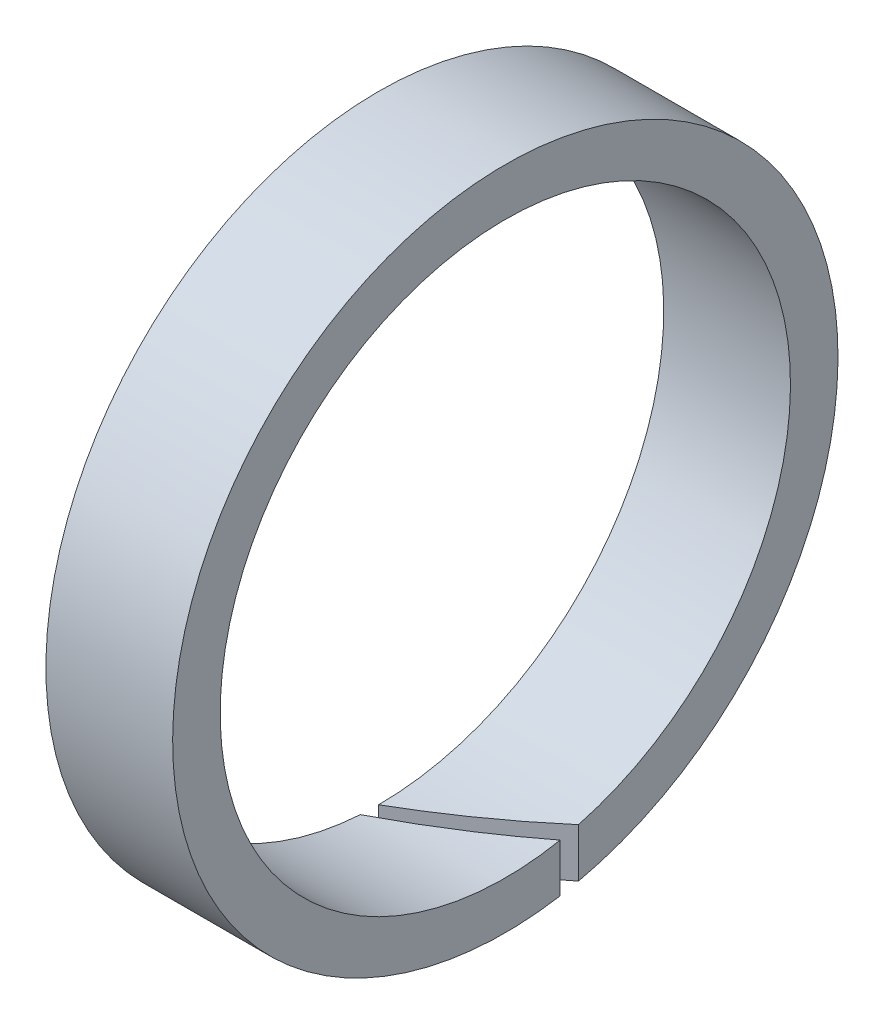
ISO-10303-21;
HEADER;
FILE_DESCRIPTION(('STEP AP214'),'2;1');
FILE_NAME('part.step','',(''),(''),'','','');
FILE_SCHEMA(('AUTOMOTIVE_DESIGN { 1 0 10303 214 1 1 1 1 }'));
ENDSEC;
DATA;
#1=APPLICATION_CONTEXT('core data for automotive mechanical design processes');
#2=APPLICATION_PROTOCOL_DEFINITION('international standard','automotive_design',2000,#1);
#3=PRODUCT_CONTEXT('',#1,'mechanical');
#4=PRODUCT('Part','Part','',(#3));
#5=PRODUCT_RELATED_PRODUCT_CATEGORY('part','',(#4));
#6=PRODUCT_DEFINITION_FORMATION('','',#4);
#7=PRODUCT_DEFINITION_CONTEXT('part definition',#1,'design');
#8=PRODUCT_DEFINITION('design','',#6,#7);
#9=PRODUCT_DEFINITION_SHAPE('','',#8);
#10=(LENGTH_UNIT() NAMED_UNIT(*) SI_UNIT(.MILLI.,.METRE.));
#11=(NAMED_UNIT(*) PLANE_ANGLE_UNIT() SI_UNIT($,.RADIAN.));
#12=(NAMED_UNIT(*) SI_UNIT($,.STERADIAN.) SOLID_ANGLE_UNIT());
#13=UNCERTAINTY_MEASURE_WITH_UNIT(LENGTH_MEASURE(1.E-05),#10,'distance_accuracy_value','');
#14=(GEOMETRIC_REPRESENTATION_CONTEXT(3) GLOBAL_UNCERTAINTY_ASSIGNED_CONTEXT((#13)) GLOBAL_UNIT_ASSIGNED_CONTEXT((#10,
#11,#12)) REPRESENTATION_CONTEXT('',''));
#15=CARTESIAN_POINT('',(0.,0.,0.));
#16=DIRECTION('',(0.,0.,1.));
#17=DIRECTION('',(1.,0.,0.));
#18=AXIS2_PLACEMENT_3D('',#15,#16,#17);
#19=CARTESIAN_POINT('',(0.,10.5,0.));
#20=DIRECTION('',(1.,0.,0.));
#21=DIRECTION('',(0.,0.,-1.));
#22=AXIS2_PLACEMENT_3D('',#19,#20,#21);
#23=PLANE('',#22);
#24=CARTESIAN_POINT('',(0.,0.,0.));
#25=DIRECTION('',(-1.,0.,0.));
#26=DIRECTION('',(0.,0.,1.));
#27=AXIS2_PLACEMENT_3D('',#24,#25,#26);
#28=CIRCLE('',#27,10.5);
#29=CARTESIAN_POINT('',(0.,-10.484114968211,0.577350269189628));
#30=VERTEX_POINT('',#29);
#31=CARTESIAN_POINT('',(0.,-10.5,0.));
#32=VERTEX_POINT('',#31);
#33=EDGE_CURVE('E81',#30,#32,#28,.T.);
#34=ORIENTED_EDGE('',*,*,#33,.T.);
#35=DIRECTION('',(0.,1.,0.));
#36=VECTOR('',#35,1.);
#37=CARTESIAN_POINT('',(0.,-10.5,0.));
#38=LINE('',#37,#36);
#39=CARTESIAN_POINT('',(0.,-9.00000000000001,0.));
#40=VERTEX_POINT('',#39);
#41=EDGE_CURVE('E67',#32,#40,#38,.T.);
#42=ORIENTED_EDGE('',*,*,#41,.T.);
#43=CARTESIAN_POINT('',(0.,0.,0.));
#44=DIRECTION('',(-1.,0.,0.));
#45=DIRECTION('',(0.,0.,1.));
#46=AXIS2_PLACEMENT_3D('',#43,#44,#45);
#47=CIRCLE('',#46,9.);
#48=CARTESIAN_POINT('',(0.,-8.98146239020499,0.577350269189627));
#49=VERTEX_POINT('',#48);
#50=EDGE_CURVE('E84',#49,#40,#47,.T.);
#51=ORIENTED_EDGE('',*,*,#50,.F.);
#52=DIRECTION('',(0.,1.,0.));
#53=VECTOR('',#52,1.);
#54=CARTESIAN_POINT('',(0.,-10.5,0.577350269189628));
#55=LINE('',#54,#53);
#56=EDGE_CURVE('E44',#30,#49,#55,.T.);
#57=ORIENTED_EDGE('',*,*,#56,.F.);
#58=EDGE_LOOP('',(#34,#42,#51,#57));
#59=FACE_BOUND('',#58,.T.);
#60=ADVANCED_FACE('F30',(#59),#23,.F.);
#61=CARTESIAN_POINT('',(0.,0.,0.));
#62=DIRECTION('',(-1.,0.,0.));
#63=DIRECTION('',(0.,0.,1.));
#64=AXIS2_PLACEMENT_3D('',#61,#62,#63);
#65=CYLINDRICAL_SURFACE('',#64,10.5);
#66=ORIENTED_EDGE('',*,*,#33,.F.);
#67=CARTESIAN_POINT('',(0.999999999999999,0.,0.));
#68=DIRECTION('',(0.500000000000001,0.,0.866025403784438));
#69=DIRECTION('',(-0.866025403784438,0.,0.500000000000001));
#70=AXIS2_PLACEMENT_3D('',#67,#68,#69);
#71=ELLIPSE('',#70,20.9999999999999,10.5);
#72=CARTESIAN_POINT('',(4.,-10.356157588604,-1.73205080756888));
#73=VERTEX_POINT('',#72);
#74=EDGE_CURVE('E75',#30,#73,#71,.T.);
#75=ORIENTED_EDGE('',*,*,#74,.T.);
#76=CARTESIAN_POINT('',(4.,0.,0.));
#77=DIRECTION('',(-1.,0.,0.));
#78=DIRECTION('',(0.,0.,1.));
#79=AXIS2_PLACEMENT_3D('',#76,#77,#78);
#80=CIRCLE('',#79,10.5);
#81=CARTESIAN_POINT('',(4.,-10.2428837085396,-2.30940107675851));
#82=VERTEX_POINT('',#81);
#83=EDGE_CURVE('E83',#73,#82,#80,.T.);
#84=ORIENTED_EDGE('',*,*,#83,.T.);
#85=CARTESIAN_POINT('',(0.,0.,0.));
#86=DIRECTION('',(-0.500000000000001,0.,-0.866025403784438));
#87=DIRECTION('',(-0.866025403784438,0.,0.500000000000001));
#88=AXIS2_PLACEMENT_3D('',#85,#86,#87);
#89=ELLIPSE('',#88,21.,10.5);
#90=EDGE_CURVE('E70',#82,#32,#89,.T.);
#91=ORIENTED_EDGE('',*,*,#90,.T.);
#92=EDGE_LOOP('',(#66,#75,#84,#91));
#93=FACE_BOUND('',#92,.T.);
#94=ADVANCED_FACE('F80',(#93),#65,.T.);
#95=CARTESIAN_POINT('',(4.,9.,0.));
#96=DIRECTION('',(-1.,0.,0.));
#97=DIRECTION('',(0.,0.,1.));
#98=AXIS2_PLACEMENT_3D('',#95,#96,#97);
#99=PLANE('',#98);
#100=CARTESIAN_POINT('',(4.,0.,0.));
#101=DIRECTION('',(-1.,0.,0.));
#102=DIRECTION('',(0.,0.,1.));
#103=AXIS2_PLACEMENT_3D('',#100,#101,#102);
#104=CIRCLE('',#103,9.);
#105=CARTESIAN_POINT('',(4.,-8.83176086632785,-1.73205080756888));
#106=VERTEX_POINT('',#105);
#107=CARTESIAN_POINT('',(4.,-8.69865890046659,-2.30940107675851));
#108=VERTEX_POINT('',#107);
#109=EDGE_CURVE('E87',#106,#108,#104,.T.);
#110=ORIENTED_EDGE('',*,*,#109,.T.);
#111=DIRECTION('',(0.,1.,0.));
#112=VECTOR('',#111,1.);
#113=CARTESIAN_POINT('',(4.,-10.5,-2.30940107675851));
#114=LINE('',#113,#112);
#115=EDGE_CURVE('E52',#82,#108,#114,.T.);
#116=ORIENTED_EDGE('',*,*,#115,.F.);
#117=ORIENTED_EDGE('',*,*,#83,.F.);
#118=DIRECTION('',(0.,1.,0.));
#119=VECTOR('',#118,1.);
#120=CARTESIAN_POINT('',(4.,-10.5,-1.73205080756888));
#121=LINE('',#120,#119);
#122=EDGE_CURVE('E95',#73,#106,#121,.T.);
#123=ORIENTED_EDGE('',*,*,#122,.T.);
#124=EDGE_LOOP('',(#110,#116,#117,#123));
#125=FACE_BOUND('',#124,.T.);
#126=ADVANCED_FACE('F101',(#125),#99,.F.);
#127=CARTESIAN_POINT('',(0.,0.,0.));
#128=DIRECTION('',(-1.,0.,0.));
#129=DIRECTION('',(0.,0.,1.));
#130=AXIS2_PLACEMENT_3D('',#127,#128,#129);
#131=CYLINDRICAL_SURFACE('',#130,9.);
#132=ORIENTED_EDGE('',*,*,#50,.T.);
#133=CARTESIAN_POINT('',(0.,0.,0.));
#134=DIRECTION('',(-0.500000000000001,0.,-0.866025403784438));
#135=DIRECTION('',(-0.866025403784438,0.,0.500000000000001));
#136=AXIS2_PLACEMENT_3D('',#133,#134,#135);
#137=ELLIPSE('',#136,18.,9.);
#138=EDGE_CURVE('E11',#40,#108,#137,.F.);
#139=ORIENTED_EDGE('',*,*,#138,.T.);
#140=ORIENTED_EDGE('',*,*,#109,.F.);
#141=CARTESIAN_POINT('',(0.999999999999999,0.,0.));
#142=DIRECTION('',(0.500000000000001,0.,0.866025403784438));
#143=DIRECTION('',(-0.866025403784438,0.,0.500000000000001));
#144=AXIS2_PLACEMENT_3D('',#141,#142,#143);
#145=ELLIPSE('',#144,18.,9.);
#146=EDGE_CURVE('E37',#106,#49,#145,.F.);
#147=ORIENTED_EDGE('',*,*,#146,.T.);
#148=EDGE_LOOP('',(#132,#139,#140,#147));
#149=FACE_BOUND('',#148,.T.);
#150=ADVANCED_FACE('F103',(#149),#131,.F.);
#151=CARTESIAN_POINT('',(4.,-10.5,-1.73205080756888));
#152=DIRECTION('',(0.500000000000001,0.,0.866025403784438));
#153=DIRECTION('',(0.866025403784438,0.,-0.500000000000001));
#154=AXIS2_PLACEMENT_3D('',#151,#152,#153);
#155=PLANE('',#154);
#156=ORIENTED_EDGE('',*,*,#56,.T.);
#157=ORIENTED_EDGE('',*,*,#146,.F.);
#158=ORIENTED_EDGE('',*,*,#122,.F.);
#159=ORIENTED_EDGE('',*,*,#74,.F.);
#160=EDGE_LOOP('',(#156,#157,#158,#159));
#161=FACE_BOUND('',#160,.T.);
#162=ADVANCED_FACE('F104',(#161),#155,.F.);
#163=CARTESIAN_POINT('',(0.,-10.5,0.));
#164=DIRECTION('',(-0.500000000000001,0.,-0.866025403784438));
#165=DIRECTION('',(-0.866025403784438,0.,0.500000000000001));
#166=AXIS2_PLACEMENT_3D('',#163,#164,#165);
#167=PLANE('',#166);
#168=ORIENTED_EDGE('',*,*,#115,.T.);
#169=ORIENTED_EDGE('',*,*,#138,.F.);
#170=ORIENTED_EDGE('',*,*,#41,.F.);
#171=ORIENTED_EDGE('',*,*,#90,.F.);
#172=EDGE_LOOP('',(#168,#169,#170,#171));
#173=FACE_BOUND('',#172,.T.);
#174=ADVANCED_FACE('F69',(#173),#167,.F.);
#175=CLOSED_SHELL('',(#60,#94,#126,#150,#162,#174));
#176=MANIFOLD_SOLID_BREP('B2',#175);
#177=ADVANCED_BREP_SHAPE_REPRESENTATION('',(#18,#176),#14);
#178=SHAPE_DEFINITION_REPRESENTATION(#9,#177);
ENDSEC;
END-ISO-10303-21;
